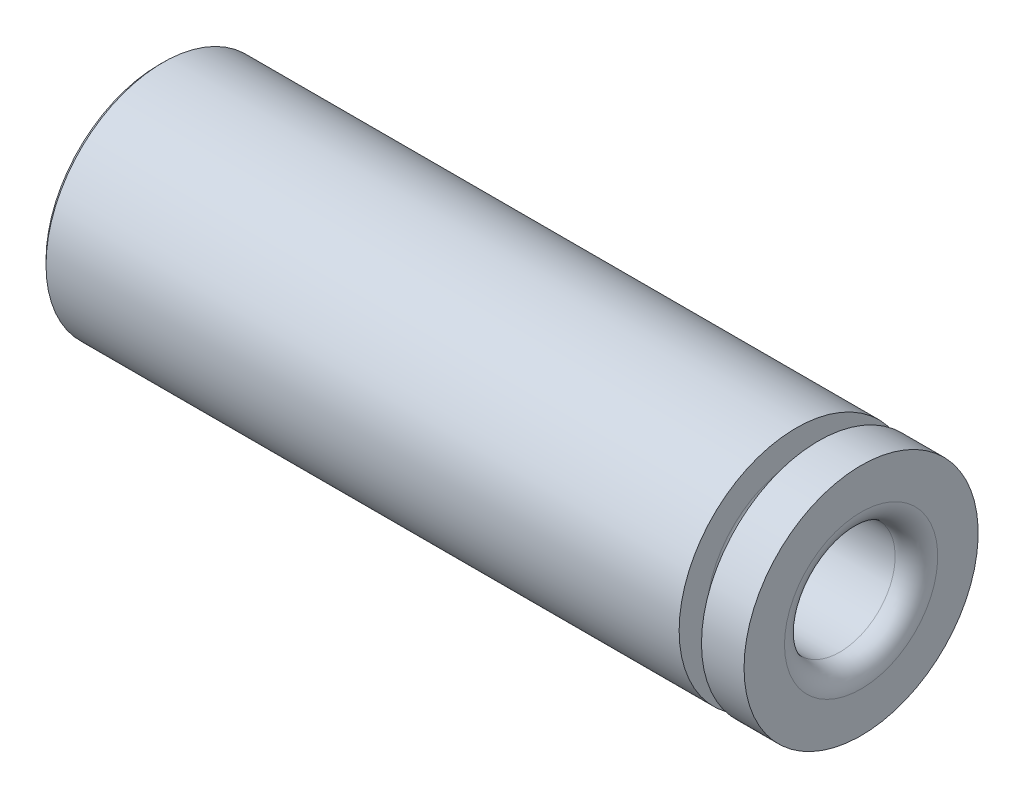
from build123d import *

# Parameters (mm, degrees)
CONG_1_R        = 1
CONG_2_R        = 0.2
CHANFREIN1_SIZE = 0.2
CHANFREIN2_SIZE = 0.3
FILLET1_R       = 0.2


with BuildPart() as part:
    # Esquisse1 → R_volution1 (revolve)
    with BuildSketch(Plane.XY, mode=Mode.PRIVATE) as r_volution1_sk:
        Polygon((0, 5.5), (0, 4.35), (6, 4.35), (6, 2.6), (33, 2.6), (33, 5.5), (31, 5.5), (31, 4), (29.95, 4), (29.95, 5.5), align=None)
    revolve(r_volution1_sk.sketch.rotate(Axis((0, 0, 0), (1, 0, 0)), 90), axis=Axis((0, 0, 0), (1, 0, 0)))

    # Cong_1
    cong_1_edges = [part.edges().sort_by_distance(p)[0] for p in [
        (33, 0, -2.6),
    ]]
    fillet(cong_1_edges, radius=CONG_1_R)

    # Cong_2
    cong_2_edges = [part.edges().sort_by_distance(p)[0] for p in [
        (6, 0, -4.35),
    ]]
    fillet(cong_2_edges, radius=CONG_2_R)

    # Chanfrein1
    chanfrein1_edges = [part.edges().sort_by_distance(p)[0] for p in [
        (0, 0, -5.5),
    ]]
    chamfer(chanfrein1_edges, length=CHANFREIN1_SIZE)

    # Chanfrein2
    chanfrein2_edges = [part.edges().sort_by_distance(p)[0] for p in [
        (0, 0, -4.35),
    ]]
    chamfer(chanfrein2_edges, length=CHANFREIN2_SIZE)

    # Fillet1
    fillet1_edges = [part.edges().sort_by_distance(p)[0] for p in [
        (29.95, 0, -4),
        (31, 0, -4),
    ]]
    fillet(fillet1_edges, radius=FILLET1_R)


solid = part.part
